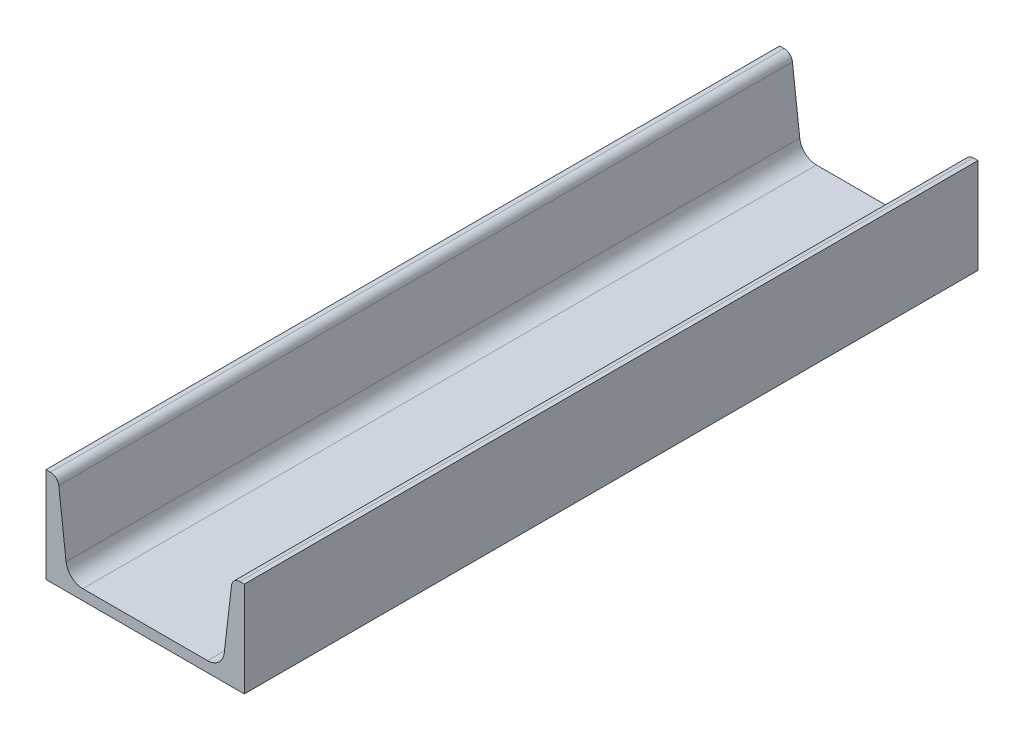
from build123d import *

# Parameters (mm, degrees)
EXTRUDE_1_DEPTH = 185


with BuildPart() as part:
    # Sketch 1 → Extrude 1 (new, symmetric)
    with BuildSketch(Plane.XY):
        with BuildLine():
            Line((-50, 0), (50, 0))
            Line((50, 0), (50, 48))
            Line((50, 48), (47.736892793, 48))
            ThreePointArc((47.736892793, 48), (44.945079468, 46.93779833), (43.565394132, 44.288465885))
            Line((43.565394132, 44.288465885), (39.879559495, 12.811438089))
            ThreePointArc((39.879559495, 12.811438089), (37.087339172, 7.449693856), (31.437240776, 5.3))
            Line((31.437240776, 5.3), (-31.437240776, 5.3))
            ThreePointArc((-31.437240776, 5.3), (-37.087339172, 7.449693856), (-39.879559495, 12.811438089))
            Line((-39.879559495, 12.811438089), (-43.565394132, 44.288465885))
            ThreePointArc((-43.565394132, 44.288465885), (-44.945079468, 46.93779833), (-47.736892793, 48))
            Line((-47.736892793, 48), (-50, 48))
            Line((-50, 48), (-50, 0))
        make_face()
    extrude(amount=EXTRUDE_1_DEPTH, both=True)


solid = part.part
